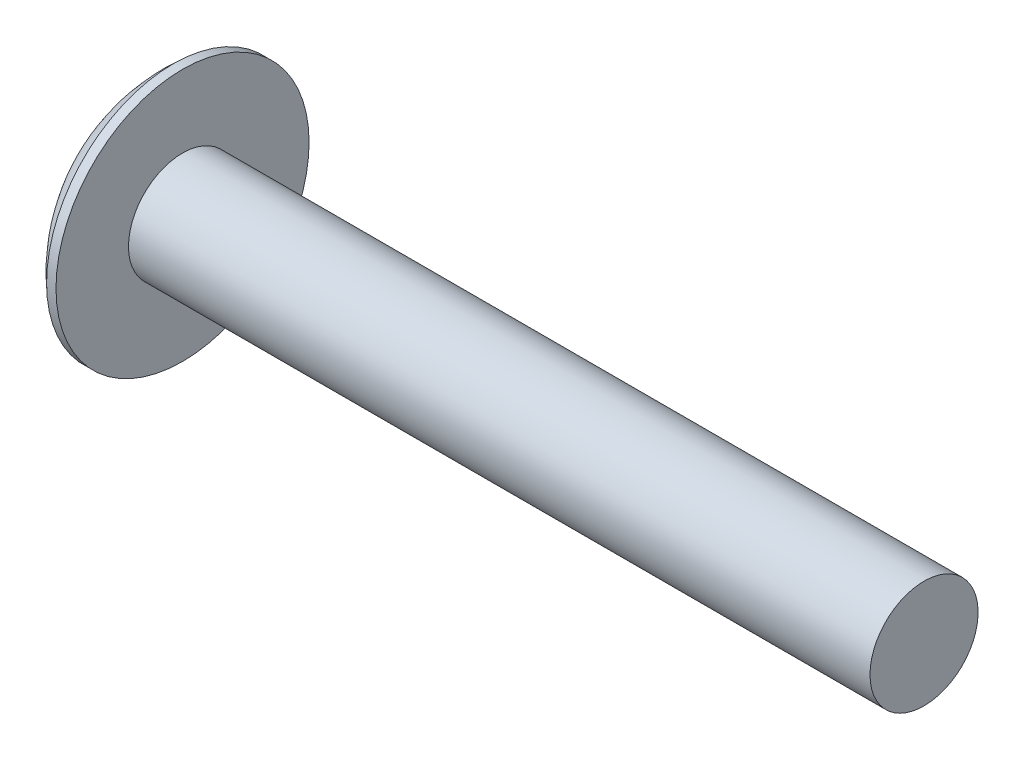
ISO-10303-21;
HEADER;
FILE_DESCRIPTION(('STEP AP214'),'2;1');
FILE_NAME('part.step','',(''),(''),'','','');
FILE_SCHEMA(('AUTOMOTIVE_DESIGN { 1 0 10303 214 1 1 1 1 }'));
ENDSEC;
DATA;
#1=APPLICATION_CONTEXT('core data for automotive mechanical design processes');
#2=APPLICATION_PROTOCOL_DEFINITION('international standard','automotive_design',2000,#1);
#3=PRODUCT_CONTEXT('',#1,'mechanical');
#4=PRODUCT('Part','Part','',(#3));
#5=PRODUCT_RELATED_PRODUCT_CATEGORY('part','',(#4));
#6=PRODUCT_DEFINITION_FORMATION('','',#4);
#7=PRODUCT_DEFINITION_CONTEXT('part definition',#1,'design');
#8=PRODUCT_DEFINITION('design','',#6,#7);
#9=PRODUCT_DEFINITION_SHAPE('','',#8);
#10=(LENGTH_UNIT() NAMED_UNIT(*) SI_UNIT(.MILLI.,.METRE.));
#11=(NAMED_UNIT(*) PLANE_ANGLE_UNIT() SI_UNIT($,.RADIAN.));
#12=(NAMED_UNIT(*) SI_UNIT($,.STERADIAN.) SOLID_ANGLE_UNIT());
#13=UNCERTAINTY_MEASURE_WITH_UNIT(LENGTH_MEASURE(1.E-05),#10,'distance_accuracy_value','');
#14=(GEOMETRIC_REPRESENTATION_CONTEXT(3) GLOBAL_UNCERTAINTY_ASSIGNED_CONTEXT((#13)) GLOBAL_UNIT_ASSIGNED_CONTEXT((#10,
#11,#12)) REPRESENTATION_CONTEXT('',''));
#15=CARTESIAN_POINT('',(0.,0.,0.));
#16=DIRECTION('',(0.,0.,1.));
#17=DIRECTION('',(1.,0.,0.));
#18=AXIS2_PLACEMENT_3D('',#15,#16,#17);
#19=CARTESIAN_POINT('',(6.4516,0.,0.));
#20=DIRECTION('',(-1.,0.,0.));
#21=DIRECTION('',(0.,1.,0.));
#22=AXIS2_PLACEMENT_3D('',#19,#20,#21);
#23=SPHERICAL_SURFACE('',#22,6.4516);
#24=CARTESIAN_POINT('',(2.22786180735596,0.,0.));
#25=DIRECTION('',(-1.,0.,0.));
#26=DIRECTION('',(0.,0.,1.));
#27=AXIS2_PLACEMENT_3D('',#24,#25,#26);
#28=CIRCLE('',#27,4.8768);
#29=CARTESIAN_POINT('',(2.22786180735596,0.,4.8768));
#30=VERTEX_POINT('',#29);
#31=EDGE_CURVE('E152',#30,#30,#28,.T.);
#32=ORIENTED_EDGE('',*,*,#31,.T.);
#33=EDGE_LOOP('',(#32));
#34=FACE_BOUND('',#33,.T.);
#35=CARTESIAN_POINT('',(6.44942836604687,-0.025635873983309,0.));
#36=DIRECTION('',(-0.0844084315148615,-0.99643124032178,0.));
#37=DIRECTION('',(0.99643124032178,-0.0844084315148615,0.));
#38=AXIS2_PLACEMENT_3D('',#35,#36,#37);
#39=CIRCLE('',#38,6.45154870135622);
#40=CARTESIAN_POINT('',(0.465142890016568,0.481297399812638,2.35665581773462));
#41=VERTEX_POINT('',#40);
#42=CARTESIAN_POINT('',(0.041592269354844,0.517176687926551,0.517176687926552));
#43=VERTEX_POINT('',#42);
#44=EDGE_CURVE('E180',#41,#43,#39,.T.);
#45=ORIENTED_EDGE('',*,*,#44,.F.);
#46=CARTESIAN_POINT('',(5.25294202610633,0.,-1.4913893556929));
#47=DIRECTION('',(0.626461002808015,0.,0.779452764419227));
#48=DIRECTION('',(0.779452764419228,0.,-0.626461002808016));
#49=AXIS2_PLACEMENT_3D('',#46,#47,#48);
#50=CIRCLE('',#49,6.16134071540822);
#51=CARTESIAN_POINT('',(0.465142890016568,-0.481297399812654,2.35665581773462));
#52=VERTEX_POINT('',#51);
#53=EDGE_CURVE('E148',#41,#52,#50,.T.);
#54=ORIENTED_EDGE('',*,*,#53,.T.);
#55=CARTESIAN_POINT('',(6.44942836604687,0.0256358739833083,0.));
#56=DIRECTION('',(-0.0844084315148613,0.99643124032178,0.));
#57=DIRECTION('',(-0.99643124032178,-0.0844084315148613,0.));
#58=AXIS2_PLACEMENT_3D('',#55,#56,#57);
#59=CIRCLE('',#58,6.45154870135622);
#60=CARTESIAN_POINT('',(0.041592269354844,-0.517176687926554,0.517176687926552));
#61=VERTEX_POINT('',#60);
#62=EDGE_CURVE('E104',#61,#52,#59,.T.);
#63=ORIENTED_EDGE('',*,*,#62,.F.);
#64=CARTESIAN_POINT('',(6.44942836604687,0.,-0.0256358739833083));
#65=DIRECTION('',(-0.0844084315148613,0.,-0.99643124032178));
#66=DIRECTION('',(-0.99643124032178,0.,0.0844084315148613));
#67=AXIS2_PLACEMENT_3D('',#64,#65,#66);
#68=CIRCLE('',#67,6.45154870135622);
#69=CARTESIAN_POINT('',(0.465142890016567,-2.35665581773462,0.481297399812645));
#70=VERTEX_POINT('',#69);
#71=EDGE_CURVE('E129',#70,#61,#68,.T.);
#72=ORIENTED_EDGE('',*,*,#71,.F.);
#73=CARTESIAN_POINT('',(5.25294202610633,1.49138935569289,0.));
#74=DIRECTION('',(0.626461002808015,-0.779452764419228,0.));
#75=DIRECTION('',(0.779452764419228,0.626461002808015,0.));
#76=AXIS2_PLACEMENT_3D('',#73,#74,#75);
#77=CIRCLE('',#76,6.16134071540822);
#78=CARTESIAN_POINT('',(0.465142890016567,-2.35665581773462,-0.481297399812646));
#79=VERTEX_POINT('',#78);
#80=EDGE_CURVE('E137',#70,#79,#77,.T.);
#81=ORIENTED_EDGE('',*,*,#80,.T.);
#82=CARTESIAN_POINT('',(6.44942836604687,0.,0.025635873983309));
#83=DIRECTION('',(-0.0844084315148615,0.,0.99643124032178));
#84=DIRECTION('',(0.99643124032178,0.,0.0844084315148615));
#85=AXIS2_PLACEMENT_3D('',#82,#83,#84);
#86=CIRCLE('',#85,6.45154870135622);
#87=CARTESIAN_POINT('',(0.041592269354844,-0.51717668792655,-0.517176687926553));
#88=VERTEX_POINT('',#87);
#89=EDGE_CURVE('E47',#88,#79,#86,.T.);
#90=ORIENTED_EDGE('',*,*,#89,.F.);
#91=CARTESIAN_POINT('',(0.465142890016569,-0.481297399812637,-2.35665581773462));
#92=VERTEX_POINT('',#91);
#93=EDGE_CURVE('E187',#92,#88,#59,.T.);
#94=ORIENTED_EDGE('',*,*,#93,.F.);
#95=CARTESIAN_POINT('',(5.25294202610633,0.,1.4913893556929));
#96=DIRECTION('',(0.626461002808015,0.,-0.779452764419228));
#97=DIRECTION('',(-0.779452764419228,0.,-0.626461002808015));
#98=AXIS2_PLACEMENT_3D('',#95,#96,#97);
#99=CIRCLE('',#98,6.16134071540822);
#100=CARTESIAN_POINT('',(0.465142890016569,0.481297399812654,-2.35665581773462));
#101=VERTEX_POINT('',#100);
#102=EDGE_CURVE('E130',#92,#101,#99,.T.);
#103=ORIENTED_EDGE('',*,*,#102,.T.);
#104=CARTESIAN_POINT('',(0.041592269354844,0.517176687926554,-0.517176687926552));
#105=VERTEX_POINT('',#104);
#106=EDGE_CURVE('E175',#105,#101,#39,.T.);
#107=ORIENTED_EDGE('',*,*,#106,.F.);
#108=CARTESIAN_POINT('',(0.465142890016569,2.35665581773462,-0.481297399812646));
#109=VERTEX_POINT('',#108);
#110=EDGE_CURVE('E40',#109,#105,#86,.T.);
#111=ORIENTED_EDGE('',*,*,#110,.F.);
#112=CARTESIAN_POINT('',(5.25294202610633,-1.4913893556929,0.));
#113=DIRECTION('',(0.626461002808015,0.779452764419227,0.));
#114=DIRECTION('',(-0.779452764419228,0.626461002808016,0.));
#115=AXIS2_PLACEMENT_3D('',#112,#113,#114);
#116=CIRCLE('',#115,6.16134071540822);
#117=CARTESIAN_POINT('',(0.465142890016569,2.35665581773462,0.481297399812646));
#118=VERTEX_POINT('',#117);
#119=EDGE_CURVE('E11',#109,#118,#116,.T.);
#120=ORIENTED_EDGE('',*,*,#119,.T.);
#121=EDGE_CURVE('E163',#43,#118,#68,.T.);
#122=ORIENTED_EDGE('',*,*,#121,.F.);
#123=EDGE_LOOP('',(#45,#54,#63,#72,#81,#90,#94,#103,#107,#111,#120,#122));
#124=FACE_BOUND('',#123,.T.);
#125=ADVANCED_FACE('F32',(#34,#124),#23,.T.);
#126=CARTESIAN_POINT('',(3.39733161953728,0.,-0.232909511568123));
#127=DIRECTION('',(-0.0844084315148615,0.,0.99643124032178));
#128=DIRECTION('',(0.99643124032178,0.,0.0844084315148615));
#129=AXIS2_PLACEMENT_3D('',#126,#127,#128);
#130=PLANE('',#129);
#131=ORIENTED_EDGE('',*,*,#110,.T.);
#132=DIRECTION('',(0.992900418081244,-0.0841093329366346,0.0841093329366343));
#133=VECTOR('',#132,1.);
#134=CARTESIAN_POINT('',(3.41678240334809,0.231261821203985,-0.231261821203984));
#135=LINE('',#134,#133);
#136=CARTESIAN_POINT('',(3.0734,0.260350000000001,-0.260349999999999));
#137=VERTEX_POINT('',#136);
#138=EDGE_CURVE('E169',#105,#137,#135,.T.);
#139=ORIENTED_EDGE('',*,*,#138,.T.);
#140=DIRECTION('',(0.777759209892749,-0.625099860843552,0.0658845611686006));
#141=VECTOR('',#140,1.);
#142=CARTESIAN_POINT('',(0.,2.7305,-0.5207));
#143=LINE('',#142,#141);
#144=EDGE_CURVE('E153',#109,#137,#143,.T.);
#145=ORIENTED_EDGE('',*,*,#144,.F.);
#146=EDGE_LOOP('',(#131,#139,#145));
#147=FACE_BOUND('',#146,.T.);
#148=ADVANCED_FACE('F168',(#147),#130,.T.);
#149=DIRECTION('',(0.777759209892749,0.625099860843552,0.0658845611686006));
#150=VECTOR('',#149,1.);
#151=CARTESIAN_POINT('',(0.,-2.7305,-0.5207));
#152=LINE('',#151,#150);
#153=CARTESIAN_POINT('',(3.0734,-0.26035,-0.26035));
#154=VERTEX_POINT('',#153);
#155=EDGE_CURVE('E138',#79,#154,#152,.T.);
#156=ORIENTED_EDGE('',*,*,#155,.T.);
#157=DIRECTION('',(-0.992900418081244,-0.0841093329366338,-0.0841093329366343));
#158=VECTOR('',#157,1.);
#159=CARTESIAN_POINT('',(3.41678240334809,-0.231261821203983,-0.231261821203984));
#160=LINE('',#159,#158);
#161=EDGE_CURVE('E190',#154,#88,#160,.T.);
#162=ORIENTED_EDGE('',*,*,#161,.T.);
#163=ORIENTED_EDGE('',*,*,#89,.T.);
#164=EDGE_LOOP('',(#156,#162,#163));
#165=FACE_BOUND('',#164,.T.);
#166=ADVANCED_FACE('F205',(#165),#130,.T.);
#167=CARTESIAN_POINT('',(3.39733161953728,0.,0.232909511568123));
#168=DIRECTION('',(-0.0844084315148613,0.,-0.99643124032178));
#169=DIRECTION('',(-0.99643124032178,0.,0.0844084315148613));
#170=AXIS2_PLACEMENT_3D('',#167,#168,#169);
#171=PLANE('',#170);
#172=DIRECTION('',(0.777759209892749,-0.625099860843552,-0.0658845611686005));
#173=VECTOR('',#172,1.);
#174=CARTESIAN_POINT('',(0.,2.7305,0.520699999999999));
#175=LINE('',#174,#173);
#176=CARTESIAN_POINT('',(3.0734,0.26035,0.26035));
#177=VERTEX_POINT('',#176);
#178=EDGE_CURVE('E206',#118,#177,#175,.T.);
#179=ORIENTED_EDGE('',*,*,#178,.T.);
#180=DIRECTION('',(-0.992900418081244,0.084109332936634,0.0841093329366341));
#181=VECTOR('',#180,1.);
#182=CARTESIAN_POINT('',(3.41678240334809,0.231261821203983,0.231261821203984));
#183=LINE('',#182,#181);
#184=EDGE_CURVE('E184',#177,#43,#183,.T.);
#185=ORIENTED_EDGE('',*,*,#184,.T.);
#186=ORIENTED_EDGE('',*,*,#121,.T.);
#187=EDGE_LOOP('',(#179,#185,#186));
#188=FACE_BOUND('',#187,.T.);
#189=ADVANCED_FACE('F210',(#188),#171,.T.);
#190=ORIENTED_EDGE('',*,*,#71,.T.);
#191=DIRECTION('',(0.992900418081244,0.0841093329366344,-0.084109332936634));
#192=VECTOR('',#191,1.);
#193=CARTESIAN_POINT('',(3.41678240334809,-0.231261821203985,0.231261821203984));
#194=LINE('',#193,#192);
#195=CARTESIAN_POINT('',(3.0734,-0.260350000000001,0.260349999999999));
#196=VERTEX_POINT('',#195);
#197=EDGE_CURVE('E102',#61,#196,#194,.T.);
#198=ORIENTED_EDGE('',*,*,#197,.T.);
#199=DIRECTION('',(0.777759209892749,0.625099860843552,-0.0658845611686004));
#200=VECTOR('',#199,1.);
#201=CARTESIAN_POINT('',(0.,-2.7305,0.520699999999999));
#202=LINE('',#201,#200);
#203=EDGE_CURVE('E127',#70,#196,#202,.T.);
#204=ORIENTED_EDGE('',*,*,#203,.F.);
#205=EDGE_LOOP('',(#190,#198,#204));
#206=FACE_BOUND('',#205,.T.);
#207=ADVANCED_FACE('F126',(#206),#171,.T.);
#208=CARTESIAN_POINT('',(-25.4,0.,0.));
#209=DIRECTION('',(-1.,0.,0.));
#210=DIRECTION('',(0.,0.,1.));
#211=AXIS2_PLACEMENT_3D('',#208,#209,#210);
#212=CYLINDRICAL_SURFACE('',#211,2.0828);
#213=CARTESIAN_POINT('',(31.1658,0.,0.));
#214=DIRECTION('',(-1.,0.,0.));
#215=DIRECTION('',(0.,0.,1.));
#216=AXIS2_PLACEMENT_3D('',#213,#214,#215);
#217=CIRCLE('',#216,2.0828);
#218=CARTESIAN_POINT('',(31.1658,0.,2.0828));
#219=VERTEX_POINT('',#218);
#220=EDGE_CURVE('E149',#219,#219,#217,.T.);
#221=ORIENTED_EDGE('',*,*,#220,.T.);
#222=EDGE_LOOP('',(#221));
#223=FACE_BOUND('',#222,.T.);
#224=CARTESIAN_POINT('',(2.5908,0.,0.));
#225=DIRECTION('',(-1.,0.,0.));
#226=DIRECTION('',(0.,0.,1.));
#227=AXIS2_PLACEMENT_3D('',#224,#225,#226);
#228=CIRCLE('',#227,2.0828);
#229=CARTESIAN_POINT('',(2.5908,0.,2.0828));
#230=VERTEX_POINT('',#229);
#231=EDGE_CURVE('E159',#230,#230,#228,.T.);
#232=ORIENTED_EDGE('',*,*,#231,.F.);
#233=EDGE_LOOP('',(#232));
#234=FACE_BOUND('',#233,.T.);
#235=ADVANCED_FACE('F34',(#223,#234),#212,.T.);
#236=CARTESIAN_POINT('',(2.5908,2.0828,0.));
#237=DIRECTION('',(-1.,0.,0.));
#238=DIRECTION('',(0.,0.,1.));
#239=AXIS2_PLACEMENT_3D('',#236,#237,#238);
#240=PLANE('',#239);
#241=CARTESIAN_POINT('',(2.5908,0.,0.));
#242=DIRECTION('',(-1.,0.,0.));
#243=DIRECTION('',(0.,0.,1.));
#244=AXIS2_PLACEMENT_3D('',#241,#242,#243);
#245=CIRCLE('',#244,4.8768);
#246=CARTESIAN_POINT('',(2.5908,0.,4.8768));
#247=VERTEX_POINT('',#246);
#248=EDGE_CURVE('E156',#247,#247,#245,.T.);
#249=ORIENTED_EDGE('',*,*,#248,.F.);
#250=EDGE_LOOP('',(#249));
#251=FACE_BOUND('',#250,.T.);
#252=ORIENTED_EDGE('',*,*,#231,.T.);
#253=EDGE_LOOP('',(#252));
#254=FACE_BOUND('',#253,.T.);
#255=ADVANCED_FACE('F234',(#251,#254),#240,.F.);
#256=CARTESIAN_POINT('',(-25.4,0.,0.));
#257=DIRECTION('',(-1.,0.,0.));
#258=DIRECTION('',(0.,0.,1.));
#259=AXIS2_PLACEMENT_3D('',#256,#257,#258);
#260=CYLINDRICAL_SURFACE('',#259,4.8768);
#261=ORIENTED_EDGE('',*,*,#248,.T.);
#262=EDGE_LOOP('',(#261));
#263=FACE_BOUND('',#262,.T.);
#264=ORIENTED_EDGE('',*,*,#31,.F.);
#265=EDGE_LOOP('',(#264));
#266=FACE_BOUND('',#265,.T.);
#267=ADVANCED_FACE('F232',(#263,#266),#260,.T.);
#268=CARTESIAN_POINT('',(31.1658,2.0828,0.));
#269=DIRECTION('',(1.,0.,0.));
#270=DIRECTION('',(0.,0.,-1.));
#271=AXIS2_PLACEMENT_3D('',#268,#269,#270);
#272=PLANE('',#271);
#273=ORIENTED_EDGE('',*,*,#220,.F.);
#274=EDGE_LOOP('',(#273));
#275=FACE_BOUND('',#274,.T.);
#276=ADVANCED_FACE('F230',(#275),#272,.T.);
#277=CARTESIAN_POINT('',(3.0734,0.26035,0.26035));
#278=DIRECTION('',(0.626461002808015,0.779452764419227,0.));
#279=DIRECTION('',(-0.779452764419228,0.626461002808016,0.));
#280=AXIS2_PLACEMENT_3D('',#277,#278,#279);
#281=PLANE('',#280);
#282=ORIENTED_EDGE('',*,*,#144,.T.);
#283=DIRECTION('',(0.,0.,-1.));
#284=VECTOR('',#283,1.);
#285=CARTESIAN_POINT('',(3.0734,0.26035,0.26035));
#286=LINE('',#285,#284);
#287=EDGE_CURVE('E120',#177,#137,#286,.T.);
#288=ORIENTED_EDGE('',*,*,#287,.F.);
#289=ORIENTED_EDGE('',*,*,#178,.F.);
#290=ORIENTED_EDGE('',*,*,#119,.F.);
#291=EDGE_LOOP('',(#282,#288,#289,#290));
#292=FACE_BOUND('',#291,.T.);
#293=ADVANCED_FACE('F209',(#292),#281,.F.);
#294=CARTESIAN_POINT('',(3.0734,-0.26035,-0.26035));
#295=DIRECTION('',(0.626461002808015,-0.779452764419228,0.));
#296=DIRECTION('',(0.779452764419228,0.626461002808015,0.));
#297=AXIS2_PLACEMENT_3D('',#294,#295,#296);
#298=PLANE('',#297);
#299=ORIENTED_EDGE('',*,*,#203,.T.);
#300=DIRECTION('',(0.,0.,1.));
#301=VECTOR('',#300,1.);
#302=CARTESIAN_POINT('',(3.0734,-0.26035,-0.26035));
#303=LINE('',#302,#301);
#304=EDGE_CURVE('E119',#154,#196,#303,.T.);
#305=ORIENTED_EDGE('',*,*,#304,.F.);
#306=ORIENTED_EDGE('',*,*,#155,.F.);
#307=ORIENTED_EDGE('',*,*,#80,.F.);
#308=EDGE_LOOP('',(#299,#305,#306,#307));
#309=FACE_BOUND('',#308,.T.);
#310=ADVANCED_FACE('F134',(#309),#298,.F.);
#311=CARTESIAN_POINT('',(3.0734,0.26035,-0.26035));
#312=DIRECTION('',(-1.,0.,0.));
#313=DIRECTION('',(0.,0.,1.));
#314=AXIS2_PLACEMENT_3D('',#311,#312,#313);
#315=PLANE('',#314);
#316=DIRECTION('',(0.,1.,0.));
#317=VECTOR('',#316,1.);
#318=CARTESIAN_POINT('',(3.0734,-0.26035,-0.26035));
#319=LINE('',#318,#317);
#320=EDGE_CURVE('E142',#154,#137,#319,.T.);
#321=ORIENTED_EDGE('',*,*,#320,.F.);
#322=ORIENTED_EDGE('',*,*,#304,.T.);
#323=DIRECTION('',(0.,-1.,0.));
#324=VECTOR('',#323,1.);
#325=CARTESIAN_POINT('',(3.0734,0.26035,0.26035));
#326=LINE('',#325,#324);
#327=EDGE_CURVE('E111',#177,#196,#326,.T.);
#328=ORIENTED_EDGE('',*,*,#327,.F.);
#329=ORIENTED_EDGE('',*,*,#287,.T.);
#330=EDGE_LOOP('',(#321,#322,#328,#329));
#331=FACE_BOUND('',#330,.T.);
#332=ADVANCED_FACE('F140',(#331),#315,.T.);
#333=CARTESIAN_POINT('',(3.0734,0.260350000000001,-0.260349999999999));
#334=DIRECTION('',(0.626461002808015,0.,-0.779452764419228));
#335=DIRECTION('',(0.779452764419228,0.,0.626461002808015));
#336=AXIS2_PLACEMENT_3D('',#333,#334,#335);
#337=PLANE('',#336);
#338=DIRECTION('',(0.777759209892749,0.0658845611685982,0.625099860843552));
#339=VECTOR('',#338,1.);
#340=CARTESIAN_POINT('',(0.,-0.520699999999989,-2.7305));
#341=LINE('',#340,#339);
#342=EDGE_CURVE('E195',#92,#154,#341,.T.);
#343=ORIENTED_EDGE('',*,*,#342,.T.);
#344=ORIENTED_EDGE('',*,*,#320,.T.);
#345=DIRECTION('',(0.777759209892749,-0.0658845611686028,0.625099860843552));
#346=VECTOR('',#345,1.);
#347=CARTESIAN_POINT('',(0.,0.52070000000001,-2.7305));
#348=LINE('',#347,#346);
#349=EDGE_CURVE('E108',#101,#137,#348,.T.);
#350=ORIENTED_EDGE('',*,*,#349,.F.);
#351=ORIENTED_EDGE('',*,*,#102,.F.);
#352=EDGE_LOOP('',(#343,#344,#350,#351));
#353=FACE_BOUND('',#352,.T.);
#354=ADVANCED_FACE('F200',(#353),#337,.F.);
#355=CARTESIAN_POINT('',(3.39733161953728,-0.232909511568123,0.));
#356=DIRECTION('',(-0.0844084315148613,0.99643124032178,0.));
#357=DIRECTION('',(-0.99643124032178,-0.0844084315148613,0.));
#358=AXIS2_PLACEMENT_3D('',#355,#356,#357);
#359=PLANE('',#358);
#360=ORIENTED_EDGE('',*,*,#93,.T.);
#361=ORIENTED_EDGE('',*,*,#161,.F.);
#362=ORIENTED_EDGE('',*,*,#342,.F.);
#363=EDGE_LOOP('',(#360,#361,#362));
#364=FACE_BOUND('',#363,.T.);
#365=ADVANCED_FACE('F204',(#364),#359,.T.);
#366=CARTESIAN_POINT('',(3.39733161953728,0.232909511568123,0.));
#367=DIRECTION('',(-0.0844084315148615,-0.99643124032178,0.));
#368=DIRECTION('',(0.99643124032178,-0.0844084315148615,0.));
#369=AXIS2_PLACEMENT_3D('',#366,#367,#368);
#370=PLANE('',#369);
#371=ORIENTED_EDGE('',*,*,#106,.T.);
#372=ORIENTED_EDGE('',*,*,#349,.T.);
#373=ORIENTED_EDGE('',*,*,#138,.F.);
#374=EDGE_LOOP('',(#371,#372,#373));
#375=FACE_BOUND('',#374,.T.);
#376=ADVANCED_FACE('F198',(#375),#370,.T.);
#377=CARTESIAN_POINT('',(3.0734,-0.260350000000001,0.260349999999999));
#378=DIRECTION('',(0.626461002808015,0.,0.779452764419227));
#379=DIRECTION('',(-0.779452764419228,0.,0.626461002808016));
#380=AXIS2_PLACEMENT_3D('',#377,#378,#379);
#381=PLANE('',#380);
#382=DIRECTION('',(0.777759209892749,-0.0658845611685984,-0.625099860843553));
#383=VECTOR('',#382,1.);
#384=CARTESIAN_POINT('',(0.,0.520699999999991,2.7305));
#385=LINE('',#384,#383);
#386=EDGE_CURVE('E107',#41,#177,#385,.T.);
#387=ORIENTED_EDGE('',*,*,#386,.T.);
#388=ORIENTED_EDGE('',*,*,#327,.T.);
#389=DIRECTION('',(0.777759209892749,0.0658845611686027,-0.625099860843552));
#390=VECTOR('',#389,1.);
#391=CARTESIAN_POINT('',(0.,-0.520700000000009,2.7305));
#392=LINE('',#391,#390);
#393=EDGE_CURVE('E98',#52,#196,#392,.T.);
#394=ORIENTED_EDGE('',*,*,#393,.F.);
#395=ORIENTED_EDGE('',*,*,#53,.F.);
#396=EDGE_LOOP('',(#387,#388,#394,#395));
#397=FACE_BOUND('',#396,.T.);
#398=ADVANCED_FACE('F112',(#397),#381,.F.);
#399=ORIENTED_EDGE('',*,*,#44,.T.);
#400=ORIENTED_EDGE('',*,*,#184,.F.);
#401=ORIENTED_EDGE('',*,*,#386,.F.);
#402=EDGE_LOOP('',(#399,#400,#401));
#403=FACE_BOUND('',#402,.T.);
#404=ADVANCED_FACE('F211',(#403),#370,.T.);
#405=ORIENTED_EDGE('',*,*,#62,.T.);
#406=ORIENTED_EDGE('',*,*,#393,.T.);
#407=ORIENTED_EDGE('',*,*,#197,.F.);
#408=EDGE_LOOP('',(#405,#406,#407));
#409=FACE_BOUND('',#408,.T.);
#410=ADVANCED_FACE('F100',(#409),#359,.T.);
#411=CLOSED_SHELL('',(#125,#148,#166,#189,#207,#235,#255,#267,#276,#293,#310,#332,#354,#365,
#376,#398,#404,#410));
#412=MANIFOLD_SOLID_BREP('B2',#411);
#413=ADVANCED_BREP_SHAPE_REPRESENTATION('',(#18,#412),#14);
#414=SHAPE_DEFINITION_REPRESENTATION(#9,#413);
ENDSEC;
END-ISO-10303-21;
